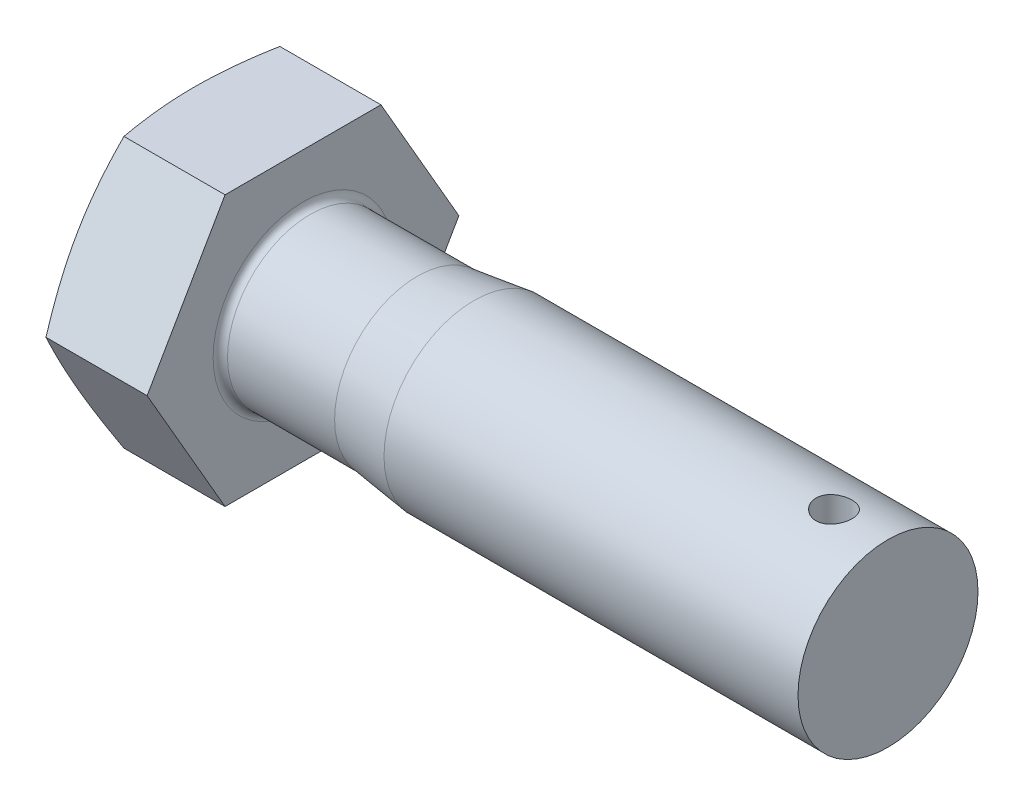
from build123d import *

# Parameters (mm, degrees)
BASEHEAD_DEPTH     = 12.5
SKETCH2_R          = 10
BASEBODY_DEPTH     = 65
SKETCH4_R          = 11.2
CUT_EXTRUDE1_DEPTH = 2.5
HEADFILLET_R       = 0.8
HOLE_DEPTH         = 81.816149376
HOLE_DEPTH_BACK    = 81.816149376
SKETCH6_R          = 2


with BuildPart() as part:
    # Sketch1 → BaseHead (new body)
    with BuildSketch(Plane(origin=(0, 0, 0), x_dir=(0, 0, -1), z_dir=(1, 0, 0))):
        Polygon((8.660254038, -15), (17.320508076, 0), (8.660254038, 15), (-8.660254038, 15), (-17.320508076, 0), (-8.660254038, -15), align=None)
    extrude(amount=BASEHEAD_DEPTH)

    # Sketch2 → BaseBody (add)
    with BuildSketch(Plane(origin=(12.5, 0, 0), x_dir=(0, 0, -1), z_dir=(1, 0, 0))):
        Circle(SKETCH2_R)
    extrude(amount=BASEBODY_DEPTH)

    # Sketch3 → HeadChamfer (revolve, cut)
    with BuildSketch(Plane(origin=(3.161211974, 0, 2.612290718), x_dir=(0, 0, -1), z_dir=(0, 1, 0)), mode=Mode.PRIVATE) as headchamfer_sk:
        Polygon((19.932798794, 3.161211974), (19.932798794, 1.898050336), (16.462290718, 3.161211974), align=None)
    revolve(headchamfer_sk.sketch.rotate(Axis((1.089857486, 0, 0), (1, 0, 0)), 180), axis=Axis((1.089857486, 0, 0), (1, 0, 0)), mode=Mode.SUBTRACT)

    # Sketch4 → Cut-Extrude1 (cut)
    with BuildSketch(Plane(origin=(0, 0, 0), x_dir=(0, 0, -1), z_dir=(1, 0, 0))):
        Circle(SKETCH4_R)
    extrude(amount=CUT_EXTRUDE1_DEPTH, mode=Mode.SUBTRACT)

    # Sketch5 → Cut-Revolve1 (revolve, cut)
    with BuildSketch(Plane(origin=(-2.92963122, 0, 7.92963122), x_dir=(0, 0, -1), z_dir=(0, 1, 0)), mode=Mode.PRIVATE) as cut_revolve1_sk:
        Polygon((17.92963122, -34.42963122), (17.11763122, -28.12963122), (17.11763122, -15.42963122), (26.30563122, -15.42963122), (26.30563122, -34.42963122), align=None)
    revolve(cut_revolve1_sk.sketch.rotate(Axis((0, 0, 0), (1, 0, 0)), 180), axis=Axis((0, 0, 0), (1, 0, 0)), mode=Mode.SUBTRACT)

    # HeadFillet
    headfillet_edges = [part.edges().sort_by_distance(p)[0] for p in [
        (12.5, 0, -9.188),
    ]]
    fillet(headfillet_edges, radius=HEADFILLET_R)

    # Sketch6 → Hole (cut, two sides: drawn at the far end of the back side and taken through both)
    with BuildSketch(Plane(origin=(0, 0, 0), x_dir=(1, 0, 0), z_dir=(0, 1, 0)).offset(-HOLE_DEPTH_BACK)):
        with Locations(Location((71.5, 0, 0), (0, 0, 270))):
            Circle(SKETCH6_R)
    extrude(amount=HOLE_DEPTH + HOLE_DEPTH_BACK, mode=Mode.SUBTRACT)


solid = part.part
